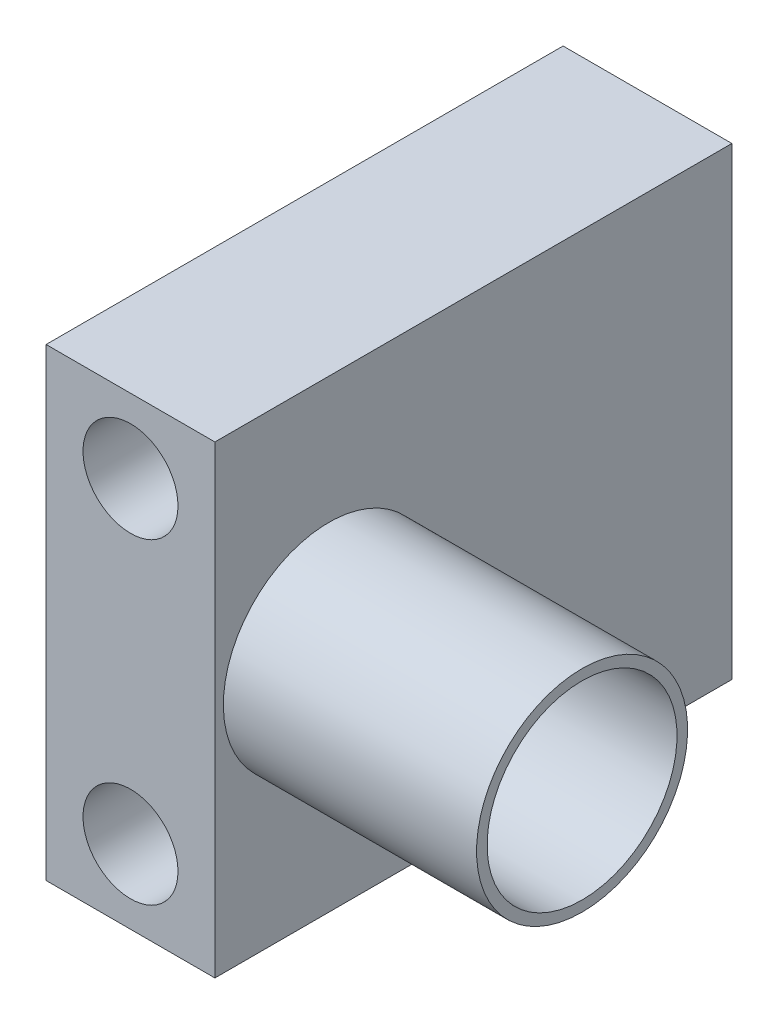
ISO-10303-21;
HEADER;
FILE_DESCRIPTION(('STEP AP214'),'2;1');
FILE_NAME('part.step','',(''),(''),'','','');
FILE_SCHEMA(('AUTOMOTIVE_DESIGN { 1 0 10303 214 1 1 1 1 }'));
ENDSEC;
DATA;
#1=APPLICATION_CONTEXT('core data for automotive mechanical design processes');
#2=APPLICATION_PROTOCOL_DEFINITION('international standard','automotive_design',2000,#1);
#3=PRODUCT_CONTEXT('',#1,'mechanical');
#4=PRODUCT('Part','Part','',(#3));
#5=PRODUCT_RELATED_PRODUCT_CATEGORY('part','',(#4));
#6=PRODUCT_DEFINITION_FORMATION('','',#4);
#7=PRODUCT_DEFINITION_CONTEXT('part definition',#1,'design');
#8=PRODUCT_DEFINITION('design','',#6,#7);
#9=PRODUCT_DEFINITION_SHAPE('','',#8);
#10=(LENGTH_UNIT() NAMED_UNIT(*) SI_UNIT(.MILLI.,.METRE.));
#11=(NAMED_UNIT(*) PLANE_ANGLE_UNIT() SI_UNIT($,.RADIAN.));
#12=(NAMED_UNIT(*) SI_UNIT($,.STERADIAN.) SOLID_ANGLE_UNIT());
#13=UNCERTAINTY_MEASURE_WITH_UNIT(LENGTH_MEASURE(1.E-05),#10,'distance_accuracy_value','');
#14=(GEOMETRIC_REPRESENTATION_CONTEXT(3) GLOBAL_UNCERTAINTY_ASSIGNED_CONTEXT((#13)) GLOBAL_UNIT_ASSIGNED_CONTEXT((#10,
#11,#12)) REPRESENTATION_CONTEXT('',''));
#15=CARTESIAN_POINT('',(0.,0.,0.));
#16=DIRECTION('',(0.,0.,1.));
#17=DIRECTION('',(1.,0.,0.));
#18=AXIS2_PLACEMENT_3D('',#15,#16,#17);
#19=CARTESIAN_POINT('',(8.,37.,49.));
#20=DIRECTION('',(-1.,0.,0.));
#21=DIRECTION('',(0.,-1.,0.));
#22=AXIS2_PLACEMENT_3D('',#19,#20,#21);
#23=PLANE('',#22);
#24=DIRECTION('',(0.,1.,0.));
#25=VECTOR('',#24,1.);
#26=CARTESIAN_POINT('',(8.,37.,0.));
#27=LINE('',#26,#25);
#28=CARTESIAN_POINT('',(8.,-7.,0.));
#29=VERTEX_POINT('',#28);
#30=CARTESIAN_POINT('',(8.,37.,0.));
#31=VERTEX_POINT('',#30);
#32=EDGE_CURVE('E62',#29,#31,#27,.T.);
#33=ORIENTED_EDGE('',*,*,#32,.T.);
#34=DIRECTION('',(0.,0.,-1.));
#35=VECTOR('',#34,1.);
#36=CARTESIAN_POINT('',(8.,37.,49.));
#37=LINE('',#36,#35);
#38=CARTESIAN_POINT('',(8.,37.,49.));
#39=VERTEX_POINT('',#38);
#40=EDGE_CURVE('E23',#39,#31,#37,.T.);
#41=ORIENTED_EDGE('',*,*,#40,.F.);
#42=DIRECTION('',(0.,1.,0.));
#43=VECTOR('',#42,1.);
#44=CARTESIAN_POINT('',(8.,37.,49.));
#45=LINE('',#44,#43);
#46=CARTESIAN_POINT('',(8.,-7.,49.));
#47=VERTEX_POINT('',#46);
#48=EDGE_CURVE('E88',#47,#39,#45,.T.);
#49=ORIENTED_EDGE('',*,*,#48,.F.);
#50=DIRECTION('',(0.,0.,-1.));
#51=VECTOR('',#50,1.);
#52=CARTESIAN_POINT('',(8.,-7.,49.));
#53=LINE('',#52,#51);
#54=EDGE_CURVE('E77',#47,#29,#53,.T.);
#55=ORIENTED_EDGE('',*,*,#54,.T.);
#56=EDGE_LOOP('',(#33,#41,#49,#55));
#57=FACE_BOUND('',#56,.T.);
#58=CARTESIAN_POINT('',(8.,15.,38.2));
#59=DIRECTION('',(-1.,0.,0.));
#60=DIRECTION('',(0.,-1.,0.));
#61=AXIS2_PLACEMENT_3D('',#58,#59,#60);
#62=CIRCLE('',#61,10.);
#63=CARTESIAN_POINT('',(8.,5.,38.2));
#64=VERTEX_POINT('',#63);
#65=EDGE_CURVE('E10',#64,#64,#62,.F.);
#66=ORIENTED_EDGE('',*,*,#65,.F.);
#67=EDGE_LOOP('',(#66));
#68=FACE_BOUND('',#67,.T.);
#69=ADVANCED_FACE('F15',(#57,#68),#23,.F.);
#70=CARTESIAN_POINT('',(8.,37.,49.));
#71=DIRECTION('',(0.,0.,-1.));
#72=DIRECTION('',(-1.,0.,0.));
#73=AXIS2_PLACEMENT_3D('',#70,#71,#72);
#74=PLANE('',#73);
#75=CARTESIAN_POINT('',(0.,30.,49.));
#76=DIRECTION('',(0.,0.,1.));
#77=DIRECTION('',(1.,0.,0.));
#78=AXIS2_PLACEMENT_3D('',#75,#76,#77);
#79=CIRCLE('',#78,4.5);
#80=CARTESIAN_POINT('',(4.5,30.,49.));
#81=VERTEX_POINT('',#80);
#82=EDGE_CURVE('E78',#81,#81,#79,.T.);
#83=ORIENTED_EDGE('',*,*,#82,.F.);
#84=EDGE_LOOP('',(#83));
#85=FACE_BOUND('',#84,.T.);
#86=ORIENTED_EDGE('',*,*,#48,.T.);
#87=DIRECTION('',(-1.,0.,0.));
#88=VECTOR('',#87,1.);
#89=CARTESIAN_POINT('',(8.,37.,49.));
#90=LINE('',#89,#88);
#91=CARTESIAN_POINT('',(-8.,37.,49.));
#92=VERTEX_POINT('',#91);
#93=EDGE_CURVE('E70',#39,#92,#90,.T.);
#94=ORIENTED_EDGE('',*,*,#93,.T.);
#95=DIRECTION('',(0.,-1.,0.));
#96=VECTOR('',#95,1.);
#97=CARTESIAN_POINT('',(-8.,37.,49.));
#98=LINE('',#97,#96);
#99=CARTESIAN_POINT('',(-8.,-7.,49.));
#100=VERTEX_POINT('',#99);
#101=EDGE_CURVE('E35',#92,#100,#98,.T.);
#102=ORIENTED_EDGE('',*,*,#101,.T.);
#103=DIRECTION('',(1.,0.,0.));
#104=VECTOR('',#103,1.);
#105=CARTESIAN_POINT('',(8.,-7.,49.));
#106=LINE('',#105,#104);
#107=EDGE_CURVE('E30',#100,#47,#106,.T.);
#108=ORIENTED_EDGE('',*,*,#107,.T.);
#109=EDGE_LOOP('',(#86,#94,#102,#108));
#110=FACE_BOUND('',#109,.T.);
#111=CARTESIAN_POINT('',(0.,0.,49.));
#112=DIRECTION('',(0.,0.,1.));
#113=DIRECTION('',(1.,0.,0.));
#114=AXIS2_PLACEMENT_3D('',#111,#112,#113);
#115=CIRCLE('',#114,4.5);
#116=CARTESIAN_POINT('',(4.5,0.,49.));
#117=VERTEX_POINT('',#116);
#118=EDGE_CURVE('E108',#117,#117,#115,.T.);
#119=ORIENTED_EDGE('',*,*,#118,.F.);
#120=EDGE_LOOP('',(#119));
#121=FACE_BOUND('',#120,.T.);
#122=ADVANCED_FACE('F101',(#85,#110,#121),#74,.F.);
#123=CARTESIAN_POINT('',(8.,37.,0.));
#124=DIRECTION('',(0.,0.,-1.));
#125=DIRECTION('',(-1.,0.,0.));
#126=AXIS2_PLACEMENT_3D('',#123,#124,#125);
#127=PLANE('',#126);
#128=CARTESIAN_POINT('',(0.,30.,0.));
#129=DIRECTION('',(0.,0.,1.));
#130=DIRECTION('',(1.,0.,0.));
#131=AXIS2_PLACEMENT_3D('',#128,#129,#130);
#132=CIRCLE('',#131,4.5);
#133=CARTESIAN_POINT('',(4.5,30.,0.));
#134=VERTEX_POINT('',#133);
#135=EDGE_CURVE('E81',#134,#134,#132,.T.);
#136=ORIENTED_EDGE('',*,*,#135,.T.);
#137=EDGE_LOOP('',(#136));
#138=FACE_BOUND('',#137,.T.);
#139=ORIENTED_EDGE('',*,*,#32,.F.);
#140=DIRECTION('',(1.,0.,0.));
#141=VECTOR('',#140,1.);
#142=CARTESIAN_POINT('',(8.,-7.,0.));
#143=LINE('',#142,#141);
#144=CARTESIAN_POINT('',(-8.,-7.,0.));
#145=VERTEX_POINT('',#144);
#146=EDGE_CURVE('E86',#145,#29,#143,.T.);
#147=ORIENTED_EDGE('',*,*,#146,.F.);
#148=DIRECTION('',(0.,-1.,0.));
#149=VECTOR('',#148,1.);
#150=CARTESIAN_POINT('',(-8.,37.,0.));
#151=LINE('',#150,#149);
#152=CARTESIAN_POINT('',(-8.,37.,0.));
#153=VERTEX_POINT('',#152);
#154=EDGE_CURVE('E63',#153,#145,#151,.T.);
#155=ORIENTED_EDGE('',*,*,#154,.F.);
#156=DIRECTION('',(-1.,0.,0.));
#157=VECTOR('',#156,1.);
#158=CARTESIAN_POINT('',(8.,37.,0.));
#159=LINE('',#158,#157);
#160=EDGE_CURVE('E56',#31,#153,#159,.T.);
#161=ORIENTED_EDGE('',*,*,#160,.F.);
#162=EDGE_LOOP('',(#139,#147,#155,#161));
#163=FACE_BOUND('',#162,.T.);
#164=CARTESIAN_POINT('',(0.,0.,0.));
#165=DIRECTION('',(0.,0.,1.));
#166=DIRECTION('',(1.,0.,0.));
#167=AXIS2_PLACEMENT_3D('',#164,#165,#166);
#168=CIRCLE('',#167,4.5);
#169=CARTESIAN_POINT('',(4.5,0.,0.));
#170=VERTEX_POINT('',#169);
#171=EDGE_CURVE('E110',#170,#170,#168,.T.);
#172=ORIENTED_EDGE('',*,*,#171,.T.);
#173=EDGE_LOOP('',(#172));
#174=FACE_BOUND('',#173,.T.);
#175=ADVANCED_FACE('F58',(#138,#163,#174),#127,.T.);
#176=CARTESIAN_POINT('',(8.,37.,49.));
#177=DIRECTION('',(0.,-1.,0.));
#178=DIRECTION('',(1.,0.,0.));
#179=AXIS2_PLACEMENT_3D('',#176,#177,#178);
#180=PLANE('',#179);
#181=ORIENTED_EDGE('',*,*,#160,.T.);
#182=DIRECTION('',(0.,0.,-1.));
#183=VECTOR('',#182,1.);
#184=CARTESIAN_POINT('',(-8.,37.,49.));
#185=LINE('',#184,#183);
#186=EDGE_CURVE('E73',#92,#153,#185,.T.);
#187=ORIENTED_EDGE('',*,*,#186,.F.);
#188=ORIENTED_EDGE('',*,*,#93,.F.);
#189=ORIENTED_EDGE('',*,*,#40,.T.);
#190=EDGE_LOOP('',(#181,#187,#188,#189));
#191=FACE_BOUND('',#190,.T.);
#192=ADVANCED_FACE('F69',(#191),#180,.F.);
#193=CARTESIAN_POINT('',(-8.,37.,49.));
#194=DIRECTION('',(1.,0.,0.));
#195=DIRECTION('',(0.,1.,0.));
#196=AXIS2_PLACEMENT_3D('',#193,#194,#195);
#197=PLANE('',#196);
#198=CARTESIAN_POINT('',(-8.,15.,38.2));
#199=DIRECTION('',(-1.,0.,0.));
#200=DIRECTION('',(0.,-1.,0.));
#201=AXIS2_PLACEMENT_3D('',#198,#199,#200);
#202=CIRCLE('',#201,6.25);
#203=CARTESIAN_POINT('',(-8.,8.75,38.2));
#204=VERTEX_POINT('',#203);
#205=EDGE_CURVE('E119',#204,#204,#202,.T.);
#206=ORIENTED_EDGE('',*,*,#205,.F.);
#207=EDGE_LOOP('',(#206));
#208=FACE_BOUND('',#207,.T.);
#209=ORIENTED_EDGE('',*,*,#154,.T.);
#210=DIRECTION('',(0.,0.,-1.));
#211=VECTOR('',#210,1.);
#212=CARTESIAN_POINT('',(-8.,-7.,49.));
#213=LINE('',#212,#211);
#214=EDGE_CURVE('E94',#100,#145,#213,.T.);
#215=ORIENTED_EDGE('',*,*,#214,.F.);
#216=ORIENTED_EDGE('',*,*,#101,.F.);
#217=ORIENTED_EDGE('',*,*,#186,.T.);
#218=EDGE_LOOP('',(#209,#215,#216,#217));
#219=FACE_BOUND('',#218,.T.);
#220=ADVANCED_FACE('F98',(#208,#219),#197,.F.);
#221=CARTESIAN_POINT('',(8.,-7.,49.));
#222=DIRECTION('',(0.,1.,0.));
#223=DIRECTION('',(0.,0.,1.));
#224=AXIS2_PLACEMENT_3D('',#221,#222,#223);
#225=PLANE('',#224);
#226=ORIENTED_EDGE('',*,*,#146,.T.);
#227=ORIENTED_EDGE('',*,*,#54,.F.);
#228=ORIENTED_EDGE('',*,*,#107,.F.);
#229=ORIENTED_EDGE('',*,*,#214,.T.);
#230=EDGE_LOOP('',(#226,#227,#228,#229));
#231=FACE_BOUND('',#230,.T.);
#232=ADVANCED_FACE('F100',(#231),#225,.F.);
#233=CARTESIAN_POINT('',(0.,30.,49.));
#234=DIRECTION('',(0.,0.,-1.));
#235=DIRECTION('',(-1.,0.,0.));
#236=AXIS2_PLACEMENT_3D('',#233,#234,#235);
#237=CYLINDRICAL_SURFACE('',#236,4.5);
#238=ORIENTED_EDGE('',*,*,#82,.T.);
#239=EDGE_LOOP('',(#238));
#240=FACE_BOUND('',#239,.T.);
#241=ORIENTED_EDGE('',*,*,#135,.F.);
#242=EDGE_LOOP('',(#241));
#243=FACE_BOUND('',#242,.T.);
#244=ADVANCED_FACE('F189',(#240,#243),#237,.F.);
#245=CARTESIAN_POINT('',(0.,0.,49.));
#246=DIRECTION('',(0.,0.,-1.));
#247=DIRECTION('',(-1.,0.,0.));
#248=AXIS2_PLACEMENT_3D('',#245,#246,#247);
#249=CYLINDRICAL_SURFACE('',#248,4.5);
#250=ORIENTED_EDGE('',*,*,#118,.T.);
#251=EDGE_LOOP('',(#250));
#252=FACE_BOUND('',#251,.T.);
#253=ORIENTED_EDGE('',*,*,#171,.F.);
#254=EDGE_LOOP('',(#253));
#255=FACE_BOUND('',#254,.T.);
#256=ADVANCED_FACE('F142',(#252,#255),#249,.F.);
#257=CARTESIAN_POINT('',(32.,15.,38.2));
#258=DIRECTION('',(-1.,0.,0.));
#259=DIRECTION('',(0.,-1.,0.));
#260=AXIS2_PLACEMENT_3D('',#257,#258,#259);
#261=CYLINDRICAL_SURFACE('',#260,10.);
#262=CARTESIAN_POINT('',(32.,15.,38.2));
#263=DIRECTION('',(1.,0.,0.));
#264=DIRECTION('',(0.,1.,0.));
#265=AXIS2_PLACEMENT_3D('',#262,#263,#264);
#266=CIRCLE('',#265,10.);
#267=CARTESIAN_POINT('',(32.,25.,38.2));
#268=VERTEX_POINT('',#267);
#269=EDGE_CURVE('E114',#268,#268,#266,.T.);
#270=ORIENTED_EDGE('',*,*,#269,.F.);
#271=EDGE_LOOP('',(#270));
#272=FACE_BOUND('',#271,.T.);
#273=ORIENTED_EDGE('',*,*,#65,.T.);
#274=EDGE_LOOP('',(#273));
#275=FACE_BOUND('',#274,.T.);
#276=ADVANCED_FACE('F136',(#272,#275),#261,.T.);
#277=CARTESIAN_POINT('',(32.,15.,38.2));
#278=DIRECTION('',(1.,0.,0.));
#279=DIRECTION('',(0.,1.,0.));
#280=AXIS2_PLACEMENT_3D('',#277,#278,#279);
#281=PLANE('',#280);
#282=CARTESIAN_POINT('',(32.,15.,38.2));
#283=DIRECTION('',(1.,0.,0.));
#284=DIRECTION('',(0.,1.,0.));
#285=AXIS2_PLACEMENT_3D('',#282,#283,#284);
#286=CIRCLE('',#285,9.);
#287=CARTESIAN_POINT('',(32.,24.,38.2));
#288=VERTEX_POINT('',#287);
#289=EDGE_CURVE('E125',#288,#288,#286,.T.);
#290=ORIENTED_EDGE('',*,*,#289,.F.);
#291=EDGE_LOOP('',(#290));
#292=FACE_BOUND('',#291,.T.);
#293=ORIENTED_EDGE('',*,*,#269,.T.);
#294=EDGE_LOOP('',(#293));
#295=FACE_BOUND('',#294,.T.);
#296=ADVANCED_FACE('F132',(#292,#295),#281,.T.);
#297=CARTESIAN_POINT('',(32.,15.,38.2));
#298=DIRECTION('',(-1.,0.,0.));
#299=DIRECTION('',(0.,-1.,0.));
#300=AXIS2_PLACEMENT_3D('',#297,#298,#299);
#301=CYLINDRICAL_SURFACE('',#300,6.25);
#302=CARTESIAN_POINT('',(9.,15.,38.2));
#303=DIRECTION('',(-1.,0.,0.));
#304=DIRECTION('',(0.,-1.,0.));
#305=AXIS2_PLACEMENT_3D('',#302,#303,#304);
#306=CIRCLE('',#305,6.25);
#307=CARTESIAN_POINT('',(9.,8.75,38.2));
#308=VERTEX_POINT('',#307);
#309=EDGE_CURVE('E18',#308,#308,#306,.F.);
#310=ORIENTED_EDGE('',*,*,#309,.T.);
#311=EDGE_LOOP('',(#310));
#312=FACE_BOUND('',#311,.T.);
#313=ORIENTED_EDGE('',*,*,#205,.T.);
#314=EDGE_LOOP('',(#313));
#315=FACE_BOUND('',#314,.T.);
#316=ADVANCED_FACE('F135',(#312,#315),#301,.F.);
#317=CARTESIAN_POINT('',(9.,37.,49.));
#318=DIRECTION('',(-1.,0.,0.));
#319=DIRECTION('',(0.,-1.,0.));
#320=AXIS2_PLACEMENT_3D('',#317,#318,#319);
#321=PLANE('',#320);
#322=CARTESIAN_POINT('',(9.,15.,38.2));
#323=DIRECTION('',(-1.,0.,0.));
#324=DIRECTION('',(0.,-1.,0.));
#325=AXIS2_PLACEMENT_3D('',#322,#323,#324);
#326=CIRCLE('',#325,9.);
#327=CARTESIAN_POINT('',(9.,6.,38.2));
#328=VERTEX_POINT('',#327);
#329=EDGE_CURVE('E122',#328,#328,#326,.F.);
#330=ORIENTED_EDGE('',*,*,#329,.T.);
#331=EDGE_LOOP('',(#330));
#332=FACE_BOUND('',#331,.T.);
#333=ORIENTED_EDGE('',*,*,#309,.F.);
#334=EDGE_LOOP('',(#333));
#335=FACE_BOUND('',#334,.T.);
#336=ADVANCED_FACE('F220',(#332,#335),#321,.F.);
#337=CARTESIAN_POINT('',(-17.4558441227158,15.,38.2));
#338=DIRECTION('',(1.,0.,0.));
#339=DIRECTION('',(0.,1.,0.));
#340=AXIS2_PLACEMENT_3D('',#337,#338,#339);
#341=CYLINDRICAL_SURFACE('',#340,9.);
#342=ORIENTED_EDGE('',*,*,#289,.T.);
#343=EDGE_LOOP('',(#342));
#344=FACE_BOUND('',#343,.T.);
#345=ORIENTED_EDGE('',*,*,#329,.F.);
#346=EDGE_LOOP('',(#345));
#347=FACE_BOUND('',#346,.T.);
#348=ADVANCED_FACE('F129',(#344,#347),#341,.F.);
#349=CLOSED_SHELL('',(#69,#122,#175,#192,#220,#232,#244,#256,#276,#296,#316,#336,#348));
#350=MANIFOLD_SOLID_BREP('B1',#349);
#351=ADVANCED_BREP_SHAPE_REPRESENTATION('',(#18,#350),#14);
#352=SHAPE_DEFINITION_REPRESENTATION(#9,#351);
ENDSEC;
END-ISO-10303-21;
